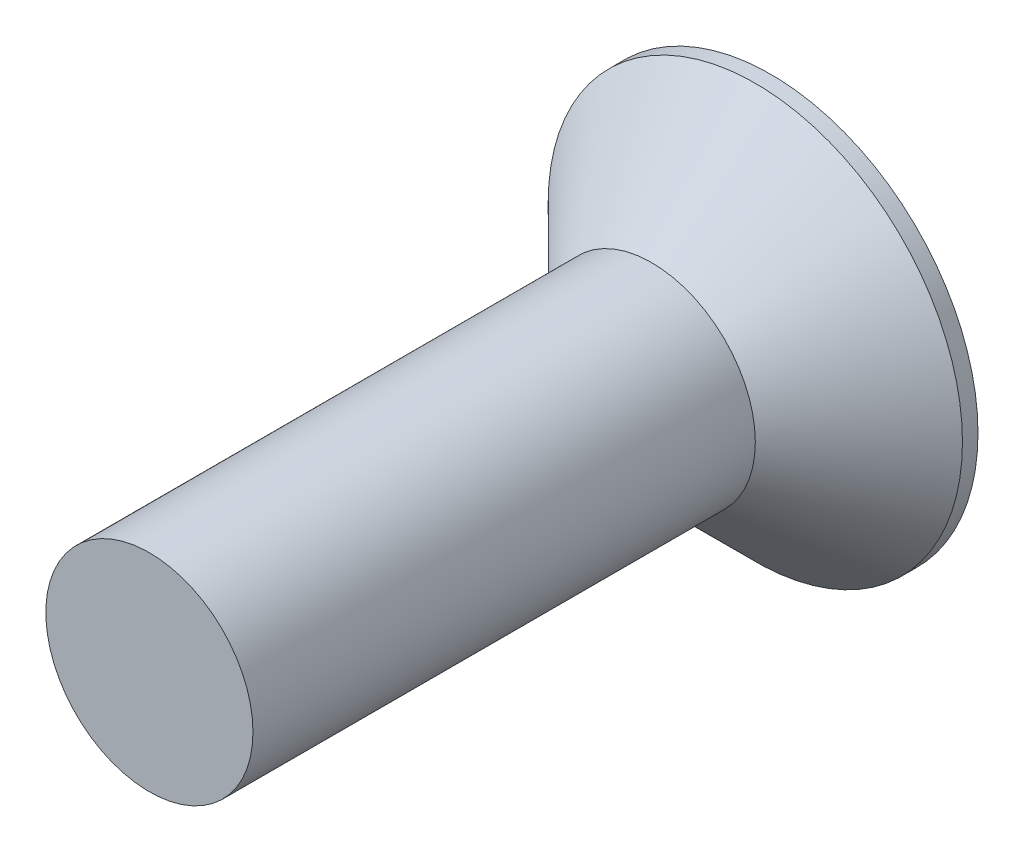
from build123d import *

# Parameters (mm, degrees)
HEX_2_DEPTH = 2


with BuildPart() as part:
    # Sketch6 → Revolve1 (revolve)
    with BuildSketch(Plane(origin=(0, 0, 0), x_dir=(0, 0, -1), z_dir=(1, 0, 0)), mode=Mode.PRIVATE) as revolve1_sk:
        Polygon((-12, 0), (-12, -2), (-2.3, -2), (-0.3, -4), (0, -4), (0, 0), align=None)
    revolve(revolve1_sk.sketch.rotate(Axis((0, 0, 12), (0, 0, -1)), 270), axis=Axis((0, 0, 12), (0, 0, -1)))

    # Sketch7 → HEX 2 (cut)
    with BuildSketch(Plane(origin=(0, 0, 0), x_dir=(-1, 0, 0), z_dir=(0, 0, -1))):
        Polygon((-1.25, 0.721687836), (-1.25, -0.721687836), (0, -1.443375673), (1.25, -0.721687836), (1.25, 0.721687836), (0, 1.443375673), align=None)
    extrude(amount=-HEX_2_DEPTH, mode=Mode.SUBTRACT)


solid = part.part
